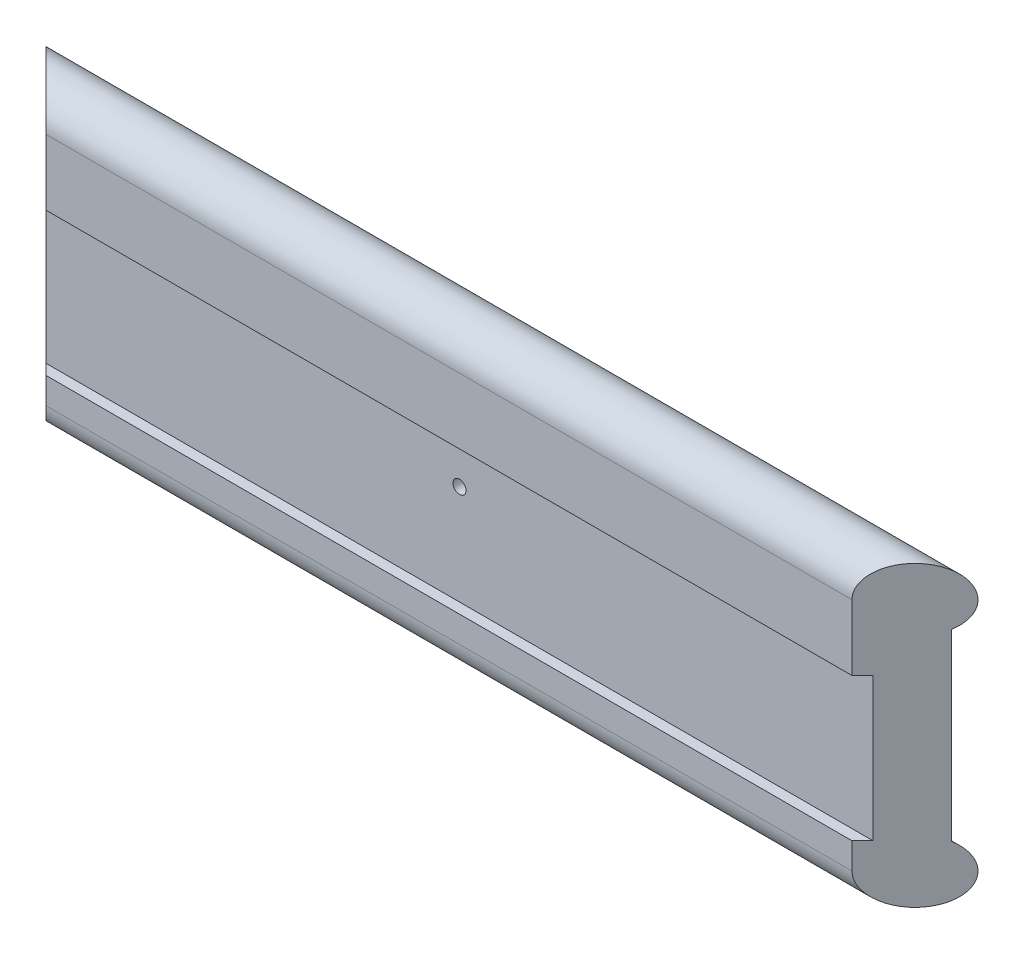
from build123d import *

# Parameters (mm, degrees)
SKETCH1_W               = 355
SKETCH1_H               = 54.5
BOSS_EXTRUDE1_DEPTH     = 15
BOSS_EXTRUDE2_DEPTH     = 355
CUT_EXTRUDE1_DEPTH      = 190.724306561
CUT_EXTRUDE1_DEPTH_BACK = 190.724306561
SKETCH4_R               = 2.5
CUT_EXTRUDE2_DEPTH      = 15


with BuildPart() as part:
    # Sketch1 → Boss-Extrude1 (new body)
    with BuildSketch(Plane.XY):
        Rectangle(SKETCH1_W, SKETCH1_H)
    extrude(amount=BOSS_EXTRUDE1_DEPTH)

    # Sketch2 → Boss-Extrude2 (add)
    with BuildSketch(Plane.ZY.offset(177.5)):
        with BuildLine():
            Line((15, 27.25), (19, 27.25))
            Line((19, 27.25), (19, 52.25))
            ThreePointArc((19, 52.25), (1.522774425, 62.927078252), (0, 42.503205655))
            Line((0, 42.503205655), (0, 27.25))
            Line((0, 27.25), (15, 27.25))
        make_face()
        with BuildLine():
            Line((0, -27.25), (15, -27.25))
            Line((15, -27.25), (19, -27.25))
            Line((19, -27.25), (19, -37.25))
            ThreePointArc((19, -37.25), (1.522774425, -47.927078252), (0, -27.503205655))
            Line((0, -27.503205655), (0, -27.25))
        make_face()
    extrude(amount=-BOSS_EXTRUDE2_DEPTH)

    # Sketch3 → Cut-Extrude1 (cut, two sides: drawn at the far end of the back side and taken through both)
    with BuildSketch(Plane(origin=(0, 0, 0), x_dir=(1, 0, 0), z_dir=(0, 1, 0)).offset(-CUT_EXTRUDE1_DEPTH_BACK)):
        Polygon((-177.5, 5), (-153.5, -19), (0, -19), (153.5, -19), (177.5, 5), (177.5, -29), (-177.5, -29), align=None)
    extrude(amount=CUT_EXTRUDE1_DEPTH + CUT_EXTRUDE1_DEPTH_BACK, mode=Mode.SUBTRACT)

    # Sketch4 → Cut-Extrude2 (cut)
    with BuildSketch(Plane.XY.offset(15)):
        with Locations((0, 10.75)):
            Circle(SKETCH4_R)
    extrude(amount=-CUT_EXTRUDE2_DEPTH, mode=Mode.SUBTRACT)


solid = part.part
